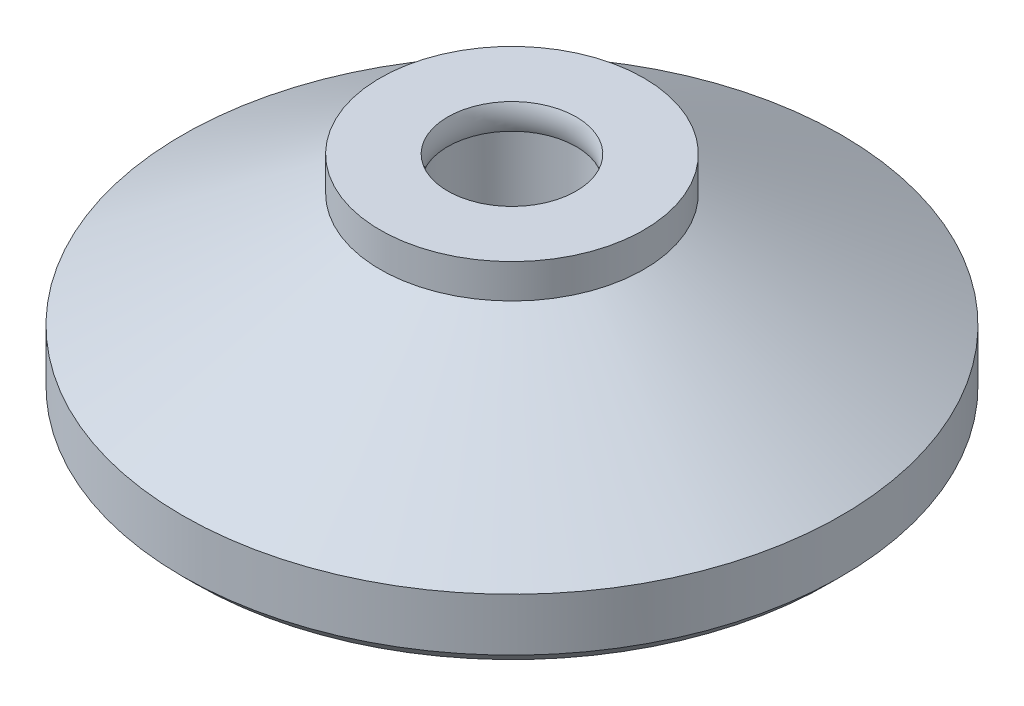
from build123d import *

# Parameters (mm, degrees)
SKETCH1_R      = 8
EXTRUDE1_DEPTH = 6.5
SKETCH3_R      = 20
EXTRUDE2_DEPTH = 4
CHAMFER1_SIZE  = 0.8


with BuildPart() as part:
    # Sketch1 → Extrude1 (new, symmetric)
    with BuildSketch(Plane(origin=(0, 0, 0), x_dir=(1, 0, 0), z_dir=(0, 1, 0))):
        with Locations(Location((0, 0, 0), (0, 0, 90))):
            Circle(SKETCH1_R)
    extrude(amount=EXTRUDE1_DEPTH, both=True)

    # Sketch3 → Extrude2 (add)
    with BuildSketch(Plane.XZ.offset(6.5)):
        with Locations(Location((0, 0, 0), (0, 0, 270))):
            Circle(SKETCH3_R)
    extrude(amount=-EXTRUDE2_DEPTH)

    # Sketch4 → Revolve1 (revolve)
    with BuildSketch(Plane.XY, mode=Mode.PRIVATE) as revolve1_sk:
        Polygon((-20, -2.5), (-8, 4.42820323), (-8, -2.5), align=None)
    revolve(revolve1_sk.sketch.rotate(Axis((0, 6.5, 0), (0, -1, 0)), 90), axis=Axis((0, 6.5, 0), (0, -1, 0)))

    # Chamfer1
    chamfer1_edges = [part.edges().sort_by_distance(p)[0] for p in [
        (0, -6.5, 20),
    ]]
    chamfer(chamfer1_edges, length=CHAMFER1_SIZE)

    # Sketch5 → Cut-Revolve1 (revolve, cut)
    with BuildSketch(Plane.XY, mode=Mode.PRIVATE) as cut_revolve1_sk:
        with BuildLine():
            Line((0, 6.5), (3.9, 6.5))
            ThreePointArc((3.9, 6.5), (3.744, 5.72), (3.9, 4.94))
            Line((3.9, 4.94), (3.9, -0.24833395))
            Line((3.9, -0.24833395), (0, -2.5))
            Line((0, -2.5), (0, 6.5))
        make_face()
    revolve(cut_revolve1_sk.sketch.rotate(Axis((0, 0, 0), (0, 1, 0)), 270), axis=Axis((0, 0, 0), (0, 1, 0)), mode=Mode.SUBTRACT)


solid = part.part
